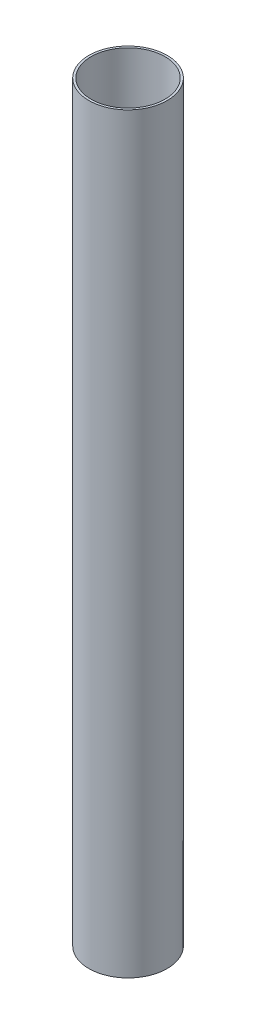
from build123d import *

# Parameters (mm, degrees)
SKETCH1_R           = 15.875
SKETCH1_R_2         = 14.986
BOSS_EXTRUDE1_DEPTH = 304.8


with BuildPart() as part:
    # Sketch1 → Boss-Extrude1 (new body)
    with BuildSketch(Plane(origin=(0, 0, 0), x_dir=(1, 0, 0), z_dir=(0, 1, 0))):
        with Locations(Location((0, 0, 0), (0, 0, 90))):
            Circle(SKETCH1_R)
        with Locations(Location((0, 0, 0), (0, 0, 90))):
            Circle(SKETCH1_R_2, mode=Mode.SUBTRACT)
    extrude(amount=BOSS_EXTRUDE1_DEPTH)


solid = part.part
